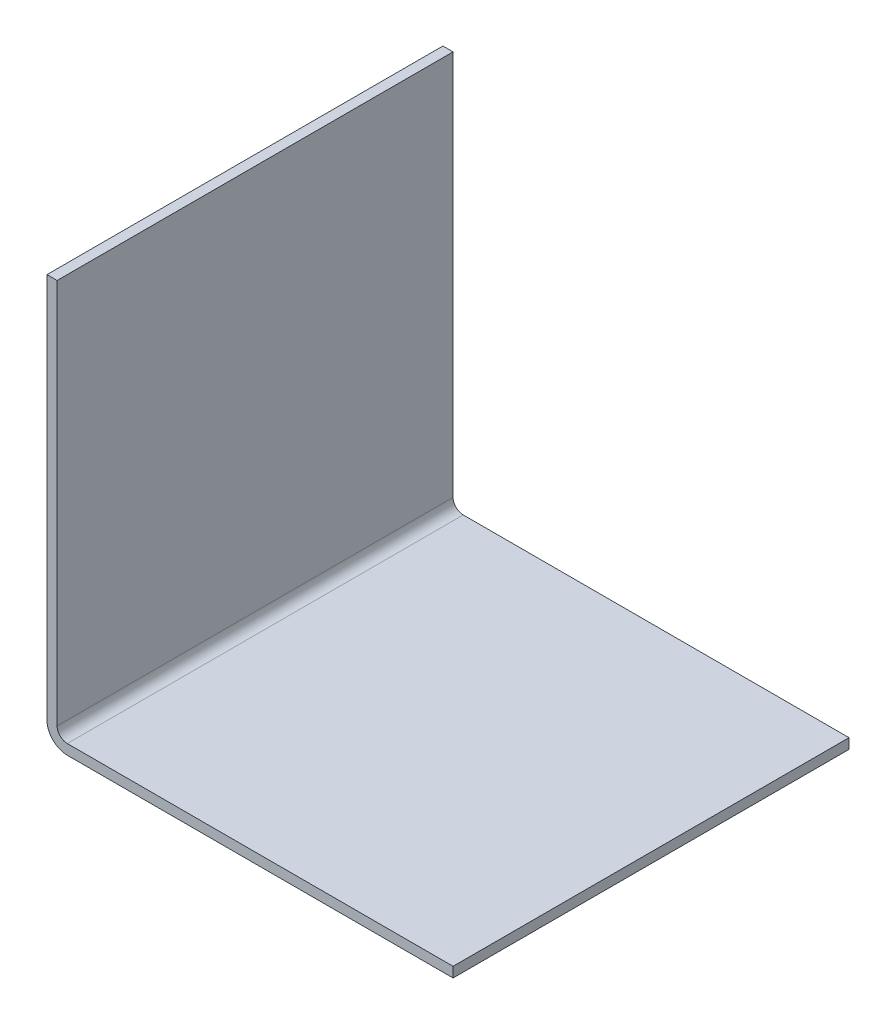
from build123d import *

# Parameters (mm, degrees)
EXTRUDE_1_DEPTH = 39


with BuildPart() as part:
    # Sketch 1 → Extrude 1 (new body)
    with BuildSketch(Plane.XY):
        with BuildLine():
            Line((2, 0), (40, 0))
            Line((40, 0), (40, 1))
            Line((40, 1), (2, 1))
            ThreePointArc((2, 1), (1.292893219, 1.292893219), (1, 2))
            Line((1, 2), (1, 40))
            Line((1, 40), (0, 40))
            Line((0, 40), (0, 2))
            ThreePointArc((0, 2), (0.585786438, 0.585786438), (2, 0))
        make_face()
    extrude(amount=EXTRUDE_1_DEPTH)


solid = part.part
